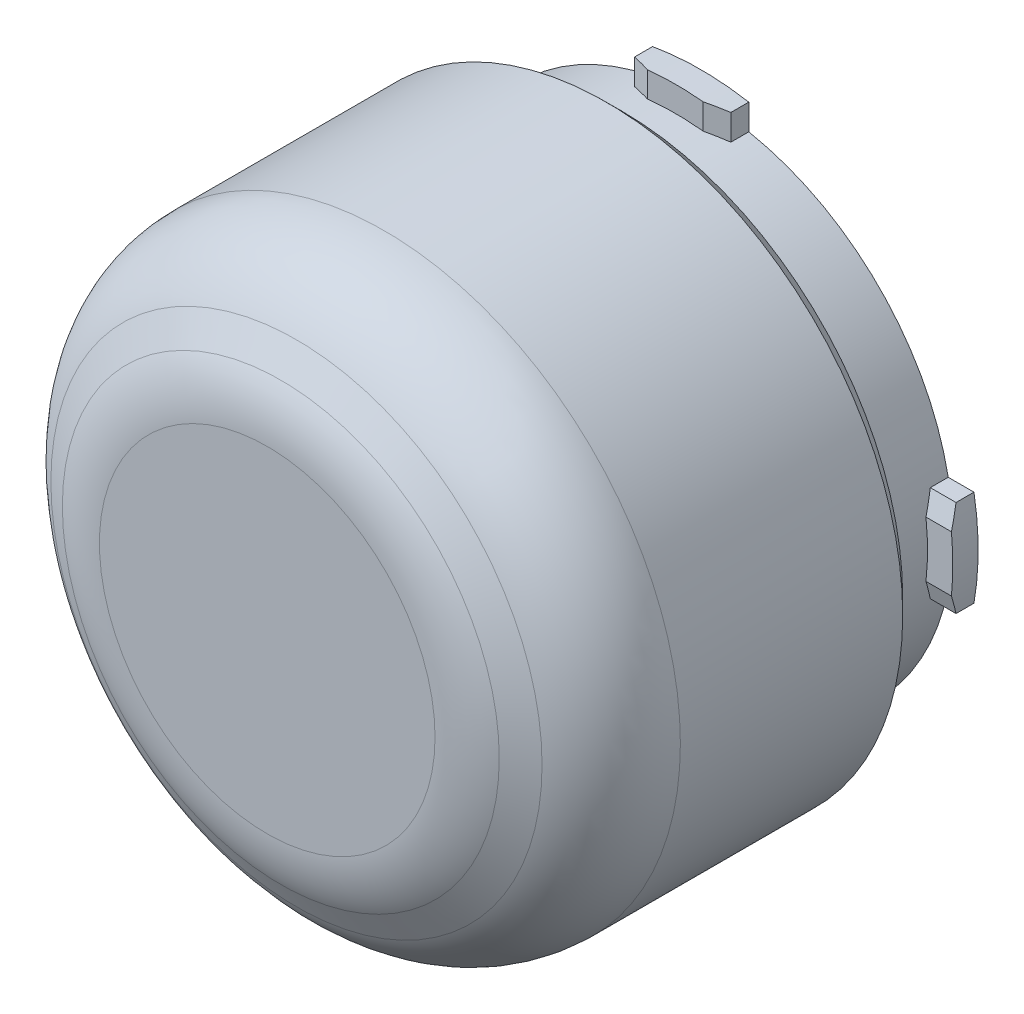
ISO-10303-21;
HEADER;
FILE_DESCRIPTION(('STEP AP214'),'2;1');
FILE_NAME('part.step','',(''),(''),'','','');
FILE_SCHEMA(('AUTOMOTIVE_DESIGN { 1 0 10303 214 1 1 1 1 }'));
ENDSEC;
DATA;
#1=APPLICATION_CONTEXT('core data for automotive mechanical design processes');
#2=APPLICATION_PROTOCOL_DEFINITION('international standard','automotive_design',2000,#1);
#3=PRODUCT_CONTEXT('',#1,'mechanical');
#4=PRODUCT('Part','Part','',(#3));
#5=PRODUCT_RELATED_PRODUCT_CATEGORY('part','',(#4));
#6=PRODUCT_DEFINITION_FORMATION('','',#4);
#7=PRODUCT_DEFINITION_CONTEXT('part definition',#1,'design');
#8=PRODUCT_DEFINITION('design','',#6,#7);
#9=PRODUCT_DEFINITION_SHAPE('','',#8);
#10=(LENGTH_UNIT() NAMED_UNIT(*) SI_UNIT(.MILLI.,.METRE.));
#11=(NAMED_UNIT(*) PLANE_ANGLE_UNIT() SI_UNIT($,.RADIAN.));
#12=(NAMED_UNIT(*) SI_UNIT($,.STERADIAN.) SOLID_ANGLE_UNIT());
#13=UNCERTAINTY_MEASURE_WITH_UNIT(LENGTH_MEASURE(1.E-05),#10,'distance_accuracy_value','');
#14=(GEOMETRIC_REPRESENTATION_CONTEXT(3) GLOBAL_UNCERTAINTY_ASSIGNED_CONTEXT((#13)) GLOBAL_UNIT_ASSIGNED_CONTEXT((#10,
#11,#12)) REPRESENTATION_CONTEXT('',''));
#15=CARTESIAN_POINT('',(0.,0.,0.));
#16=DIRECTION('',(0.,0.,1.));
#17=DIRECTION('',(1.,0.,0.));
#18=AXIS2_PLACEMENT_3D('',#15,#16,#17);
#19=CARTESIAN_POINT('',(0.,0.,35.));
#20=DIRECTION('',(0.,0.,-1.));
#21=DIRECTION('',(-1.,0.,0.));
#22=AXIS2_PLACEMENT_3D('',#19,#20,#21);
#23=CYLINDRICAL_SURFACE('',#22,29.25);
#24=CARTESIAN_POINT('',(0.,0.,23.4529946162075));
#25=DIRECTION('',(0.,0.,1.));
#26=DIRECTION('',(1.,0.,0.));
#27=AXIS2_PLACEMENT_3D('',#24,#25,#26);
#28=CIRCLE('',#27,29.25);
#29=CARTESIAN_POINT('',(29.25,0.,23.4529946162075));
#30=VERTEX_POINT('',#29);
#31=EDGE_CURVE('E11',#30,#30,#28,.F.);
#32=ORIENTED_EDGE('',*,*,#31,.T.);
#33=EDGE_LOOP('',(#32));
#34=FACE_BOUND('',#33,.T.);
#35=CARTESIAN_POINT('',(0.,0.,1.5));
#36=DIRECTION('',(0.,0.,1.));
#37=DIRECTION('',(1.,0.,0.));
#38=AXIS2_PLACEMENT_3D('',#35,#36,#37);
#39=CIRCLE('',#38,29.25);
#40=CARTESIAN_POINT('',(29.25,0.,1.5));
#41=VERTEX_POINT('',#40);
#42=EDGE_CURVE('E334',#41,#41,#39,.T.);
#43=ORIENTED_EDGE('',*,*,#42,.T.);
#44=EDGE_LOOP('',(#43));
#45=FACE_BOUND('',#44,.T.);
#46=ADVANCED_FACE('F33',(#34,#45),#23,.T.);
#47=CARTESIAN_POINT('',(0.,0.,35.));
#48=DIRECTION('',(0.,0.,1.));
#49=DIRECTION('',(1.,0.,0.));
#50=AXIS2_PLACEMENT_3D('',#47,#48,#49);
#51=PLANE('',#50);
#52=CARTESIAN_POINT('',(0.,0.,35.));
#53=DIRECTION('',(0.,0.,1.));
#54=DIRECTION('',(1.,0.,0.));
#55=AXIS2_PLACEMENT_3D('',#52,#53,#54);
#56=CIRCLE('',#55,16.5705080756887);
#57=CARTESIAN_POINT('',(16.5705080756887,0.,35.));
#58=VERTEX_POINT('',#57);
#59=EDGE_CURVE('E340',#58,#58,#56,.T.);
#60=ORIENTED_EDGE('',*,*,#59,.T.);
#61=EDGE_LOOP('',(#60));
#62=FACE_BOUND('',#61,.T.);
#63=ADVANCED_FACE('F357',(#62),#51,.T.);
#64=CARTESIAN_POINT('',(0.,0.,0.));
#65=DIRECTION('',(0.,0.,1.));
#66=DIRECTION('',(1.,0.,0.));
#67=AXIS2_PLACEMENT_3D('',#64,#65,#66);
#68=PLANE('',#67);
#69=CARTESIAN_POINT('',(0.,0.,0.));
#70=DIRECTION('',(0.,0.,1.));
#71=DIRECTION('',(1.,0.,0.));
#72=AXIS2_PLACEMENT_3D('',#69,#70,#71);
#73=CIRCLE('',#72,27.75);
#74=CARTESIAN_POINT('',(27.75,0.,0.));
#75=VERTEX_POINT('',#74);
#76=EDGE_CURVE('E337',#75,#75,#73,.F.);
#77=ORIENTED_EDGE('',*,*,#76,.T.);
#78=EDGE_LOOP('',(#77));
#79=FACE_BOUND('',#78,.T.);
#80=CARTESIAN_POINT('',(0.,0.,0.));
#81=DIRECTION('',(0.,0.,-1.));
#82=DIRECTION('',(-1.,0.,0.));
#83=AXIS2_PLACEMENT_3D('',#80,#81,#82);
#84=CIRCLE('',#83,24.9);
#85=CARTESIAN_POINT('',(-24.9,0.,0.));
#86=VERTEX_POINT('',#85);
#87=EDGE_CURVE('E221',#86,#86,#84,.T.);
#88=ORIENTED_EDGE('',*,*,#87,.F.);
#89=EDGE_LOOP('',(#88));
#90=FACE_BOUND('',#89,.T.);
#91=ADVANCED_FACE('F359',(#79,#90),#68,.F.);
#92=CARTESIAN_POINT('',(0.,0.,35.));
#93=DIRECTION('',(0.,0.,-1.));
#94=DIRECTION('',(-1.,0.,0.));
#95=AXIS2_PLACEMENT_3D('',#92,#93,#94);
#96=CONICAL_SURFACE('',#95,19.2499999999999,1.0471975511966);
#97=CARTESIAN_POINT('',(0.,0.,33.6602540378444));
#98=DIRECTION('',(0.,0.,1.));
#99=DIRECTION('',(1.,0.,0.));
#100=AXIS2_PLACEMENT_3D('',#97,#98,#99);
#101=CIRCLE('',#100,21.5705080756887);
#102=CARTESIAN_POINT('',(21.5705080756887,0.,33.6602540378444));
#103=VERTEX_POINT('',#102);
#104=EDGE_CURVE('E41',#103,#103,#101,.F.);
#105=ORIENTED_EDGE('',*,*,#104,.T.);
#106=EDGE_LOOP('',(#105));
#107=FACE_BOUND('',#106,.T.);
#108=CARTESIAN_POINT('',(0.,0.,32.1132486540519));
#109=DIRECTION('',(0.,0.,-1.));
#110=DIRECTION('',(-1.,0.,0.));
#111=AXIS2_PLACEMENT_3D('',#108,#109,#110);
#112=CIRCLE('',#111,24.25);
#113=CARTESIAN_POINT('',(-24.25,0.,32.1132486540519));
#114=VERTEX_POINT('',#113);
#115=EDGE_CURVE('E343',#114,#114,#112,.F.);
#116=ORIENTED_EDGE('',*,*,#115,.T.);
#117=EDGE_LOOP('',(#116));
#118=FACE_BOUND('',#117,.T.);
#119=ADVANCED_FACE('F348',(#107,#118),#96,.T.);
#120=CARTESIAN_POINT('',(0.,0.,72.9278354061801));
#121=DIRECTION('',(0.,0.,-1.));
#122=DIRECTION('',(-1.,0.,0.));
#123=AXIS2_PLACEMENT_3D('',#120,#121,#122);
#124=CYLINDRICAL_SURFACE('',#123,24.9);
#125=DIRECTION('',(0.,0.,-1.));
#126=VECTOR('',#125,1.);
#127=CARTESIAN_POINT('',(24.4427392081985,-4.74999999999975,-5.3));
#128=LINE('',#127,#126);
#129=CARTESIAN_POINT('',(24.4427392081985,-4.74999999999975,-6.0279404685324));
#130=VERTEX_POINT('',#129);
#131=CARTESIAN_POINT('',(24.4427392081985,-4.74999999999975,-7.8));
#132=VERTEX_POINT('',#131);
#133=EDGE_CURVE('E301',#130,#132,#128,.T.);
#134=ORIENTED_EDGE('',*,*,#133,.F.);
#135=CARTESIAN_POINT('',(0.,0.,-4.29908185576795));
#136=DIRECTION('',(0.,0.342020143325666,-0.939692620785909));
#137=DIRECTION('',(0.,-0.939692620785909,-0.342020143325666));
#138=AXIS2_PLACEMENT_3D('',#135,#136,#137);
#139=ELLIPSE('',#138,26.4980265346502,24.9);
#140=CARTESIAN_POINT('',(24.747676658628,-2.74999999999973,-5.3));
#141=VERTEX_POINT('',#140);
#142=EDGE_CURVE('E318',#130,#141,#139,.F.);
#143=ORIENTED_EDGE('',*,*,#142,.T.);
#144=CARTESIAN_POINT('',(0.,0.,-5.3));
#145=DIRECTION('',(0.,0.,1.));
#146=DIRECTION('',(0.,-1.,0.));
#147=AXIS2_PLACEMENT_3D('',#144,#145,#146);
#148=CIRCLE('',#147,24.9);
#149=CARTESIAN_POINT('',(24.7476766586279,2.75000000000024,-5.3));
#150=VERTEX_POINT('',#149);
#151=EDGE_CURVE('E313',#141,#150,#148,.T.);
#152=ORIENTED_EDGE('',*,*,#151,.T.);
#153=CARTESIAN_POINT('',(0.,0.,-4.29908185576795));
#154=DIRECTION('',(0.,-0.342020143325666,-0.939692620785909));
#155=DIRECTION('',(0.,0.939692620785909,-0.342020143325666));
#156=AXIS2_PLACEMENT_3D('',#153,#154,#155);
#157=ELLIPSE('',#156,26.4980265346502,24.9);
#158=CARTESIAN_POINT('',(24.4427392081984,4.75000000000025,-6.0279404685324));
#159=VERTEX_POINT('',#158);
#160=EDGE_CURVE('E48',#150,#159,#157,.F.);
#161=ORIENTED_EDGE('',*,*,#160,.T.);
#162=DIRECTION('',(0.,0.,-1.));
#163=VECTOR('',#162,1.);
#164=CARTESIAN_POINT('',(24.4427392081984,4.75000000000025,-5.3));
#165=LINE('',#164,#163);
#166=CARTESIAN_POINT('',(24.4427392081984,4.75000000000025,-7.8));
#167=VERTEX_POINT('',#166);
#168=EDGE_CURVE('E194',#159,#167,#165,.T.);
#169=ORIENTED_EDGE('',*,*,#168,.T.);
#170=CARTESIAN_POINT('',(0.,0.,-7.8));
#171=DIRECTION('',(0.,0.,-1.));
#172=DIRECTION('',(-1.,0.,0.));
#173=AXIS2_PLACEMENT_3D('',#170,#171,#172);
#174=CIRCLE('',#173,24.9);
#175=CARTESIAN_POINT('',(4.75,24.4427392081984,-7.8));
#176=VERTEX_POINT('',#175);
#177=EDGE_CURVE('E201',#176,#167,#174,.T.);
#178=ORIENTED_EDGE('',*,*,#177,.F.);
#179=DIRECTION('',(0.,0.,-1.));
#180=VECTOR('',#179,1.);
#181=CARTESIAN_POINT('',(4.75,24.4427392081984,-5.3));
#182=LINE('',#181,#180);
#183=CARTESIAN_POINT('',(4.75,24.4427392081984,-6.0279404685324));
#184=VERTEX_POINT('',#183);
#185=EDGE_CURVE('E238',#184,#176,#182,.T.);
#186=ORIENTED_EDGE('',*,*,#185,.F.);
#187=CARTESIAN_POINT('',(0.,0.,-4.29908185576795));
#188=DIRECTION('',(-0.342020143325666,0.,-0.939692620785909));
#189=DIRECTION('',(0.939692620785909,0.,-0.342020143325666));
#190=AXIS2_PLACEMENT_3D('',#187,#188,#189);
#191=ELLIPSE('',#190,26.4980265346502,24.9);
#192=CARTESIAN_POINT('',(2.74999999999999,24.747676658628,-5.3));
#193=VERTEX_POINT('',#192);
#194=EDGE_CURVE('E467',#184,#193,#191,.F.);
#195=ORIENTED_EDGE('',*,*,#194,.T.);
#196=CARTESIAN_POINT('',(0.,0.,-5.3));
#197=DIRECTION('',(0.,0.,1.));
#198=DIRECTION('',(1.,0.,0.));
#199=AXIS2_PLACEMENT_3D('',#196,#197,#198);
#200=CIRCLE('',#199,24.9);
#201=CARTESIAN_POINT('',(-2.74999999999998,24.747676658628,-5.3));
#202=VERTEX_POINT('',#201);
#203=EDGE_CURVE('E251',#193,#202,#200,.T.);
#204=ORIENTED_EDGE('',*,*,#203,.T.);
#205=CARTESIAN_POINT('',(0.,0.,-4.29908185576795));
#206=DIRECTION('',(0.342020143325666,0.,-0.939692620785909));
#207=DIRECTION('',(-0.939692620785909,0.,-0.342020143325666));
#208=AXIS2_PLACEMENT_3D('',#205,#206,#207);
#209=ELLIPSE('',#208,26.4980265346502,24.9);
#210=CARTESIAN_POINT('',(-4.75,24.4427392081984,-6.0279404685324));
#211=VERTEX_POINT('',#210);
#212=EDGE_CURVE('E469',#202,#211,#209,.F.);
#213=ORIENTED_EDGE('',*,*,#212,.T.);
#214=DIRECTION('',(0.,0.,-1.));
#215=VECTOR('',#214,1.);
#216=CARTESIAN_POINT('',(-4.75,24.4427392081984,-5.3));
#217=LINE('',#216,#215);
#218=CARTESIAN_POINT('',(-4.75,24.4427392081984,-7.8));
#219=VERTEX_POINT('',#218);
#220=EDGE_CURVE('E244',#211,#219,#217,.T.);
#221=ORIENTED_EDGE('',*,*,#220,.T.);
#222=CARTESIAN_POINT('',(-24.4427392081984,4.74999999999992,-7.8));
#223=VERTEX_POINT('',#222);
#224=EDGE_CURVE('E224',#223,#219,#174,.T.);
#225=ORIENTED_EDGE('',*,*,#224,.F.);
#226=DIRECTION('',(0.,0.,-1.));
#227=VECTOR('',#226,1.);
#228=CARTESIAN_POINT('',(-24.4427392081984,4.74999999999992,-5.3));
#229=LINE('',#228,#227);
#230=CARTESIAN_POINT('',(-24.4427392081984,4.74999999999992,-6.0279404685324));
#231=VERTEX_POINT('',#230);
#232=EDGE_CURVE('E256',#231,#223,#229,.T.);
#233=ORIENTED_EDGE('',*,*,#232,.F.);
#234=CARTESIAN_POINT('',(0.,0.,-4.29908185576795));
#235=DIRECTION('',(0.,-0.342020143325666,-0.939692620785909));
#236=DIRECTION('',(0.,0.939692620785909,-0.342020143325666));
#237=AXIS2_PLACEMENT_3D('',#234,#235,#236);
#238=ELLIPSE('',#237,26.4980265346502,24.9);
#239=CARTESIAN_POINT('',(-24.747676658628,2.7499999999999,-5.3));
#240=VERTEX_POINT('',#239);
#241=EDGE_CURVE('E485',#231,#240,#238,.F.);
#242=ORIENTED_EDGE('',*,*,#241,.T.);
#243=CARTESIAN_POINT('',(0.,0.,-5.3));
#244=DIRECTION('',(0.,0.,1.));
#245=DIRECTION('',(0.,1.,0.));
#246=AXIS2_PLACEMENT_3D('',#243,#244,#245);
#247=CIRCLE('',#246,24.9);
#248=CARTESIAN_POINT('',(-24.747676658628,-2.75000000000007,-5.3));
#249=VERTEX_POINT('',#248);
#250=EDGE_CURVE('E271',#240,#249,#247,.T.);
#251=ORIENTED_EDGE('',*,*,#250,.T.);
#252=CARTESIAN_POINT('',(0.,0.,-4.29908185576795));
#253=DIRECTION('',(0.,0.342020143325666,-0.939692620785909));
#254=DIRECTION('',(0.,-0.939692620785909,-0.342020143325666));
#255=AXIS2_PLACEMENT_3D('',#252,#253,#254);
#256=ELLIPSE('',#255,26.4980265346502,24.9);
#257=CARTESIAN_POINT('',(-24.4427392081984,-4.75000000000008,-6.0279404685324));
#258=VERTEX_POINT('',#257);
#259=EDGE_CURVE('E487',#249,#258,#256,.F.);
#260=ORIENTED_EDGE('',*,*,#259,.T.);
#261=DIRECTION('',(0.,0.,-1.));
#262=VECTOR('',#261,1.);
#263=CARTESIAN_POINT('',(-24.4427392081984,-4.75000000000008,-5.3));
#264=LINE('',#263,#262);
#265=CARTESIAN_POINT('',(-24.4427392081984,-4.75000000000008,-7.8));
#266=VERTEX_POINT('',#265);
#267=EDGE_CURVE('E261',#258,#266,#264,.T.);
#268=ORIENTED_EDGE('',*,*,#267,.T.);
#269=CARTESIAN_POINT('',(-4.75,-24.4427392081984,-7.8));
#270=VERTEX_POINT('',#269);
#271=EDGE_CURVE('E229',#270,#266,#174,.T.);
#272=ORIENTED_EDGE('',*,*,#271,.F.);
#273=DIRECTION('',(0.,0.,-1.));
#274=VECTOR('',#273,1.);
#275=CARTESIAN_POINT('',(-4.75,-24.4427392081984,-5.3));
#276=LINE('',#275,#274);
#277=CARTESIAN_POINT('',(-4.75,-24.4427392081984,-6.0279404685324));
#278=VERTEX_POINT('',#277);
#279=EDGE_CURVE('E278',#278,#270,#276,.T.);
#280=ORIENTED_EDGE('',*,*,#279,.F.);
#281=CARTESIAN_POINT('',(0.,0.,-4.29908185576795));
#282=DIRECTION('',(0.342020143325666,0.,-0.939692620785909));
#283=DIRECTION('',(-0.939692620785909,0.,-0.342020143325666));
#284=AXIS2_PLACEMENT_3D('',#281,#282,#283);
#285=ELLIPSE('',#284,26.4980265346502,24.9);
#286=CARTESIAN_POINT('',(-2.74999999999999,-24.747676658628,-5.3));
#287=VERTEX_POINT('',#286);
#288=EDGE_CURVE('E503',#278,#287,#285,.F.);
#289=ORIENTED_EDGE('',*,*,#288,.T.);
#290=CARTESIAN_POINT('',(0.,0.,-5.3));
#291=DIRECTION('',(0.,0.,1.));
#292=DIRECTION('',(-1.,0.,0.));
#293=AXIS2_PLACEMENT_3D('',#290,#291,#292);
#294=CIRCLE('',#293,24.9);
#295=CARTESIAN_POINT('',(2.74999999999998,-24.747676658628,-5.3));
#296=VERTEX_POINT('',#295);
#297=EDGE_CURVE('E294',#287,#296,#294,.T.);
#298=ORIENTED_EDGE('',*,*,#297,.T.);
#299=CARTESIAN_POINT('',(0.,0.,-4.29908185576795));
#300=DIRECTION('',(-0.342020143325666,0.,-0.939692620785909));
#301=DIRECTION('',(0.939692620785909,0.,-0.342020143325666));
#302=AXIS2_PLACEMENT_3D('',#299,#300,#301);
#303=ELLIPSE('',#302,26.4980265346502,24.9);
#304=CARTESIAN_POINT('',(4.75,-24.4427392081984,-6.0279404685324));
#305=VERTEX_POINT('',#304);
#306=EDGE_CURVE('E505',#296,#305,#303,.F.);
#307=ORIENTED_EDGE('',*,*,#306,.T.);
#308=DIRECTION('',(0.,0.,-1.));
#309=VECTOR('',#308,1.);
#310=CARTESIAN_POINT('',(4.75,-24.4427392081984,-5.3));
#311=LINE('',#310,#309);
#312=CARTESIAN_POINT('',(4.75,-24.4427392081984,-7.8));
#313=VERTEX_POINT('',#312);
#314=EDGE_CURVE('E283',#305,#313,#311,.T.);
#315=ORIENTED_EDGE('',*,*,#314,.T.);
#316=EDGE_CURVE('E222',#132,#313,#174,.T.);
#317=ORIENTED_EDGE('',*,*,#316,.F.);
#318=EDGE_LOOP('',(#134,#143,#152,#161,#169,#178,#186,#195,#204,#213,#221,#225,#233,#242,#251,
#260,#268,#272,#280,#289,#298,#307,#315,#317));
#319=FACE_BOUND('',#318,.T.);
#320=ORIENTED_EDGE('',*,*,#87,.T.);
#321=EDGE_LOOP('',(#320));
#322=FACE_BOUND('',#321,.T.);
#323=ADVANCED_FACE('F197',(#319,#322),#124,.T.);
#324=CARTESIAN_POINT('',(0.,0.,72.9278354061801));
#325=DIRECTION('',(0.,0.,-1.));
#326=DIRECTION('',(-1.,0.,0.));
#327=AXIS2_PLACEMENT_3D('',#324,#325,#326);
#328=CYLINDRICAL_SURFACE('',#327,22.9);
#329=CARTESIAN_POINT('',(0.,0.,3.15000000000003));
#330=DIRECTION('',(0.,0.,1.));
#331=DIRECTION('',(1.,0.,0.));
#332=AXIS2_PLACEMENT_3D('',#329,#330,#331);
#333=CIRCLE('',#332,22.9);
#334=CARTESIAN_POINT('',(22.9,0.,3.15000000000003));
#335=VERTEX_POINT('',#334);
#336=EDGE_CURVE('E327',#335,#335,#333,.T.);
#337=ORIENTED_EDGE('',*,*,#336,.T.);
#338=EDGE_LOOP('',(#337));
#339=FACE_BOUND('',#338,.T.);
#340=CARTESIAN_POINT('',(0.,0.,-7.8));
#341=DIRECTION('',(0.,0.,-1.));
#342=DIRECTION('',(-1.,0.,0.));
#343=AXIS2_PLACEMENT_3D('',#340,#341,#342);
#344=CIRCLE('',#343,22.9);
#345=CARTESIAN_POINT('',(-22.9,0.,-7.8));
#346=VERTEX_POINT('',#345);
#347=EDGE_CURVE('E231',#346,#346,#344,.T.);
#348=ORIENTED_EDGE('',*,*,#347,.T.);
#349=EDGE_LOOP('',(#348));
#350=FACE_BOUND('',#349,.T.);
#351=ADVANCED_FACE('F423',(#339,#350),#328,.F.);
#352=CARTESIAN_POINT('',(0.,0.,-7.8));
#353=DIRECTION('',(0.,0.,-1.));
#354=DIRECTION('',(-1.,0.,0.));
#355=AXIS2_PLACEMENT_3D('',#352,#353,#354);
#356=PLANE('',#355);
#357=ORIENTED_EDGE('',*,*,#177,.T.);
#358=DIRECTION('',(1.,0.,0.));
#359=VECTOR('',#358,1.);
#360=CARTESIAN_POINT('',(26.9851347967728,4.75000000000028,-7.8));
#361=LINE('',#360,#359);
#362=CARTESIAN_POINT('',(26.9851347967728,4.75000000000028,-7.8));
#363=VERTEX_POINT('',#362);
#364=EDGE_CURVE('E207',#167,#363,#361,.T.);
#365=ORIENTED_EDGE('',*,*,#364,.T.);
#366=CARTESIAN_POINT('',(-2.31065167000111E-12,0.,-7.8));
#367=DIRECTION('',(0.,0.,-1.));
#368=DIRECTION('',(0.,-1.,0.));
#369=AXIS2_PLACEMENT_3D('',#366,#367,#368);
#370=CIRCLE('',#369,27.4000000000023);
#371=CARTESIAN_POINT('',(26.9851347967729,-4.74999999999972,-7.8));
#372=VERTEX_POINT('',#371);
#373=EDGE_CURVE('E213',#363,#372,#370,.T.);
#374=ORIENTED_EDGE('',*,*,#373,.T.);
#375=DIRECTION('',(-1.,0.,0.));
#376=VECTOR('',#375,1.);
#377=CARTESIAN_POINT('',(26.9851347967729,-4.74999999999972,-7.8));
#378=LINE('',#377,#376);
#379=EDGE_CURVE('E310',#372,#132,#378,.T.);
#380=ORIENTED_EDGE('',*,*,#379,.T.);
#381=ORIENTED_EDGE('',*,*,#316,.T.);
#382=DIRECTION('',(0.,-1.,0.));
#383=VECTOR('',#382,1.);
#384=CARTESIAN_POINT('',(4.75,-26.9851347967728,-7.8));
#385=LINE('',#384,#383);
#386=CARTESIAN_POINT('',(4.75,-26.9851347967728,-7.8));
#387=VERTEX_POINT('',#386);
#388=EDGE_CURVE('E298',#313,#387,#385,.T.);
#389=ORIENTED_EDGE('',*,*,#388,.T.);
#390=CARTESIAN_POINT('',(0.,2.31065167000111E-12,-7.8));
#391=DIRECTION('',(0.,0.,-1.));
#392=DIRECTION('',(-1.,0.,0.));
#393=AXIS2_PLACEMENT_3D('',#390,#391,#392);
#394=CIRCLE('',#393,27.4000000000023);
#395=CARTESIAN_POINT('',(-4.75,-26.9851347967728,-7.8));
#396=VERTEX_POINT('',#395);
#397=EDGE_CURVE('E295',#387,#396,#394,.T.);
#398=ORIENTED_EDGE('',*,*,#397,.T.);
#399=DIRECTION('',(0.,1.,0.));
#400=VECTOR('',#399,1.);
#401=CARTESIAN_POINT('',(-4.75,-26.9851347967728,-7.8));
#402=LINE('',#401,#400);
#403=EDGE_CURVE('E291',#396,#270,#402,.T.);
#404=ORIENTED_EDGE('',*,*,#403,.T.);
#405=ORIENTED_EDGE('',*,*,#271,.T.);
#406=DIRECTION('',(-1.,0.,0.));
#407=VECTOR('',#406,1.);
#408=CARTESIAN_POINT('',(-26.9851347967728,-4.75000000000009,-7.8));
#409=LINE('',#408,#407);
#410=CARTESIAN_POINT('',(-26.9851347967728,-4.7500000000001,-7.8));
#411=VERTEX_POINT('',#410);
#412=EDGE_CURVE('E275',#266,#411,#409,.T.);
#413=ORIENTED_EDGE('',*,*,#412,.T.);
#414=CARTESIAN_POINT('',(2.31065167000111E-12,0.,-7.8));
#415=DIRECTION('',(0.,0.,-1.));
#416=DIRECTION('',(0.,1.,0.));
#417=AXIS2_PLACEMENT_3D('',#414,#415,#416);
#418=CIRCLE('',#417,27.4000000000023);
#419=CARTESIAN_POINT('',(-26.9851347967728,4.74999999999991,-7.8));
#420=VERTEX_POINT('',#419);
#421=EDGE_CURVE('E272',#411,#420,#418,.T.);
#422=ORIENTED_EDGE('',*,*,#421,.T.);
#423=DIRECTION('',(1.,0.,0.));
#424=VECTOR('',#423,1.);
#425=CARTESIAN_POINT('',(-26.9851347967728,4.74999999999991,-7.8));
#426=LINE('',#425,#424);
#427=EDGE_CURVE('E269',#420,#223,#426,.T.);
#428=ORIENTED_EDGE('',*,*,#427,.T.);
#429=ORIENTED_EDGE('',*,*,#224,.T.);
#430=DIRECTION('',(0.,1.,0.));
#431=VECTOR('',#430,1.);
#432=CARTESIAN_POINT('',(-4.75,26.9851347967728,-7.8));
#433=LINE('',#432,#431);
#434=CARTESIAN_POINT('',(-4.75,26.9851347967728,-7.8));
#435=VERTEX_POINT('',#434);
#436=EDGE_CURVE('E254',#219,#435,#433,.T.);
#437=ORIENTED_EDGE('',*,*,#436,.T.);
#438=CARTESIAN_POINT('',(0.,-2.31065167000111E-12,-7.8));
#439=DIRECTION('',(0.,0.,-1.));
#440=DIRECTION('',(1.,0.,0.));
#441=AXIS2_PLACEMENT_3D('',#438,#439,#440);
#442=CIRCLE('',#441,27.4000000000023);
#443=CARTESIAN_POINT('',(4.75,26.9851347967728,-7.8));
#444=VERTEX_POINT('',#443);
#445=EDGE_CURVE('E252',#435,#444,#442,.T.);
#446=ORIENTED_EDGE('',*,*,#445,.T.);
#447=DIRECTION('',(0.,-1.,0.));
#448=VECTOR('',#447,1.);
#449=CARTESIAN_POINT('',(4.75,26.9851347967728,-7.8));
#450=LINE('',#449,#448);
#451=EDGE_CURVE('E220',#444,#176,#450,.T.);
#452=ORIENTED_EDGE('',*,*,#451,.T.);
#453=EDGE_LOOP('',(#357,#365,#374,#380,#381,#389,#398,#404,#405,#413,#422,#428,#429,#437,#446,#452));
#454=FACE_BOUND('',#453,.T.);
#455=ORIENTED_EDGE('',*,*,#347,.F.);
#456=EDGE_LOOP('',(#455));
#457=FACE_BOUND('',#456,.T.);
#458=ADVANCED_FACE('F216',(#454,#457),#356,.T.);
#459=CARTESIAN_POINT('',(0.,0.,32.5));
#460=DIRECTION('',(0.,0.,1.));
#461=DIRECTION('',(1.,0.,0.));
#462=AXIS2_PLACEMENT_3D('',#459,#460,#461);
#463=PLANE('',#462);
#464=CARTESIAN_POINT('',(0.,0.,32.5));
#465=DIRECTION('',(0.,0.,1.));
#466=DIRECTION('',(1.,0.,0.));
#467=AXIS2_PLACEMENT_3D('',#464,#465,#466);
#468=CIRCLE('',#467,18.5801270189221);
#469=CARTESIAN_POINT('',(18.5801270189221,0.,32.5));
#470=VERTEX_POINT('',#469);
#471=EDGE_CURVE('E226',#470,#470,#468,.T.);
#472=ORIENTED_EDGE('',*,*,#471,.F.);
#473=EDGE_LOOP('',(#472));
#474=FACE_BOUND('',#473,.T.);
#475=ADVANCED_FACE('F437',(#474),#463,.F.);
#476=CARTESIAN_POINT('',(0.,0.,32.8349364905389));
#477=DIRECTION('',(0.,0.,-1.));
#478=DIRECTION('',(-1.,0.,0.));
#479=AXIS2_PLACEMENT_3D('',#476,#477,#478);
#480=CONICAL_SURFACE('',#479,17.9999999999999,1.0471975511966);
#481=CARTESIAN_POINT('',(0.,0.,27.7831216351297));
#482=DIRECTION('',(0.,0.,-1.));
#483=DIRECTION('',(-1.,0.,0.));
#484=AXIS2_PLACEMENT_3D('',#481,#482,#483);
#485=CIRCLE('',#484,26.75);
#486=CARTESIAN_POINT('',(-26.75,0.,27.7831216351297));
#487=VERTEX_POINT('',#486);
#488=EDGE_CURVE('E448',#487,#487,#485,.T.);
#489=ORIENTED_EDGE('',*,*,#488,.T.);
#490=EDGE_LOOP('',(#489));
#491=FACE_BOUND('',#490,.T.);
#492=ORIENTED_EDGE('',*,*,#471,.T.);
#493=EDGE_LOOP('',(#492));
#494=FACE_BOUND('',#493,.T.);
#495=ADVANCED_FACE('F371',(#491,#494),#480,.F.);
#496=CARTESIAN_POINT('',(0.,0.,35.));
#497=DIRECTION('',(0.,0.,-1.));
#498=DIRECTION('',(-1.,0.,0.));
#499=AXIS2_PLACEMENT_3D('',#496,#497,#498);
#500=CYLINDRICAL_SURFACE('',#499,26.75);
#501=CARTESIAN_POINT('',(0.,0.,7.00000000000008));
#502=DIRECTION('',(0.,0.,-1.));
#503=DIRECTION('',(-1.,0.,0.));
#504=AXIS2_PLACEMENT_3D('',#501,#502,#503);
#505=CIRCLE('',#504,26.75);
#506=CARTESIAN_POINT('',(-26.75,0.,7.00000000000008));
#507=VERTEX_POINT('',#506);
#508=EDGE_CURVE('E324',#507,#507,#505,.T.);
#509=ORIENTED_EDGE('',*,*,#508,.T.);
#510=EDGE_LOOP('',(#509));
#511=FACE_BOUND('',#510,.T.);
#512=ORIENTED_EDGE('',*,*,#488,.F.);
#513=EDGE_LOOP('',(#512));
#514=FACE_BOUND('',#513,.T.);
#515=ADVANCED_FACE('F433',(#511,#514),#500,.F.);
#516=CARTESIAN_POINT('',(4.75,26.9851347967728,-5.3));
#517=DIRECTION('',(1.,0.,0.));
#518=DIRECTION('',(0.,0.,-1.));
#519=AXIS2_PLACEMENT_3D('',#516,#517,#518);
#520=PLANE('',#519);
#521=DIRECTION('',(0.,0.,-1.));
#522=VECTOR('',#521,1.);
#523=CARTESIAN_POINT('',(4.75,26.9851347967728,-5.3));
#524=LINE('',#523,#522);
#525=CARTESIAN_POINT('',(4.75,26.9851347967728,-6.0279404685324));
#526=VERTEX_POINT('',#525);
#527=EDGE_CURVE('E241',#526,#444,#524,.T.);
#528=ORIENTED_EDGE('',*,*,#527,.F.);
#529=DIRECTION('',(0.,-1.,0.));
#530=VECTOR('',#529,1.);
#531=CARTESIAN_POINT('',(4.75,26.9851347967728,-6.0279404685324));
#532=LINE('',#531,#530);
#533=EDGE_CURVE('E451',#526,#184,#532,.T.);
#534=ORIENTED_EDGE('',*,*,#533,.T.);
#535=ORIENTED_EDGE('',*,*,#185,.T.);
#536=ORIENTED_EDGE('',*,*,#451,.F.);
#537=EDGE_LOOP('',(#528,#534,#535,#536));
#538=FACE_BOUND('',#537,.T.);
#539=ADVANCED_FACE('F435',(#538),#520,.T.);
#540=CARTESIAN_POINT('',(0.,-2.31065167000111E-12,-5.3));
#541=DIRECTION('',(0.,0.,-1.));
#542=DIRECTION('',(-1.,0.,0.));
#543=AXIS2_PLACEMENT_3D('',#540,#541,#542);
#544=CYLINDRICAL_SURFACE('',#543,27.4000000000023);
#545=CARTESIAN_POINT('',(0.,-2.31065167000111E-12,-5.3));
#546=DIRECTION('',(0.,0.,-1.));
#547=DIRECTION('',(1.,0.,0.));
#548=AXIS2_PLACEMENT_3D('',#545,#546,#547);
#549=CIRCLE('',#548,27.4000000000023);
#550=CARTESIAN_POINT('',(-2.74999999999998,27.2616488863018,-5.3));
#551=VERTEX_POINT('',#550);
#552=CARTESIAN_POINT('',(2.74999999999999,27.2616488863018,-5.3));
#553=VERTEX_POINT('',#552);
#554=EDGE_CURVE('E247',#551,#553,#549,.T.);
#555=ORIENTED_EDGE('',*,*,#554,.T.);
#556=CARTESIAN_POINT('',(0.,-2.31065167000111E-12,-4.29908185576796));
#557=DIRECTION('',(-0.342020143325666,0.,-0.939692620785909));
#558=DIRECTION('',(0.939692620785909,0.,-0.342020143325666));
#559=AXIS2_PLACEMENT_3D('',#556,#557,#558);
#560=ELLIPSE('',#559,29.1584709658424,27.4000000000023);
#561=EDGE_CURVE('E462',#553,#526,#560,.T.);
#562=ORIENTED_EDGE('',*,*,#561,.T.);
#563=ORIENTED_EDGE('',*,*,#527,.T.);
#564=ORIENTED_EDGE('',*,*,#445,.F.);
#565=DIRECTION('',(0.,0.,-1.));
#566=VECTOR('',#565,1.);
#567=CARTESIAN_POINT('',(-4.75,26.9851347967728,-5.3));
#568=LINE('',#567,#566);
#569=CARTESIAN_POINT('',(-4.75,26.9851347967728,-6.0279404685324));
#570=VERTEX_POINT('',#569);
#571=EDGE_CURVE('E246',#570,#435,#568,.T.);
#572=ORIENTED_EDGE('',*,*,#571,.F.);
#573=CARTESIAN_POINT('',(0.,-2.31065167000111E-12,-4.29908185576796));
#574=DIRECTION('',(0.342020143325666,0.,-0.939692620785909));
#575=DIRECTION('',(-0.939692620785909,0.,-0.342020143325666));
#576=AXIS2_PLACEMENT_3D('',#573,#574,#575);
#577=ELLIPSE('',#576,29.1584709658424,27.4000000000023);
#578=EDGE_CURVE('E460',#570,#551,#577,.T.);
#579=ORIENTED_EDGE('',*,*,#578,.T.);
#580=EDGE_LOOP('',(#555,#562,#563,#564,#572,#579));
#581=FACE_BOUND('',#580,.T.);
#582=ADVANCED_FACE('F574',(#581),#544,.T.);
#583=CARTESIAN_POINT('',(-4.75,26.9851347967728,-5.3));
#584=DIRECTION('',(-1.,0.,0.));
#585=DIRECTION('',(0.,0.,1.));
#586=AXIS2_PLACEMENT_3D('',#583,#584,#585);
#587=PLANE('',#586);
#588=ORIENTED_EDGE('',*,*,#220,.F.);
#589=DIRECTION('',(0.,1.,0.));
#590=VECTOR('',#589,1.);
#591=CARTESIAN_POINT('',(-4.75,26.9851347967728,-6.0279404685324));
#592=LINE('',#591,#590);
#593=EDGE_CURVE('E464',#211,#570,#592,.T.);
#594=ORIENTED_EDGE('',*,*,#593,.T.);
#595=ORIENTED_EDGE('',*,*,#571,.T.);
#596=ORIENTED_EDGE('',*,*,#436,.F.);
#597=EDGE_LOOP('',(#588,#594,#595,#596));
#598=FACE_BOUND('',#597,.T.);
#599=ADVANCED_FACE('F561',(#598),#587,.T.);
#600=CARTESIAN_POINT('',(0.,0.,-5.3));
#601=DIRECTION('',(0.,0.,1.));
#602=DIRECTION('',(1.,0.,0.));
#603=AXIS2_PLACEMENT_3D('',#600,#601,#602);
#604=PLANE('',#603);
#605=ORIENTED_EDGE('',*,*,#203,.F.);
#606=DIRECTION('',(0.,1.,0.));
#607=VECTOR('',#606,1.);
#608=CARTESIAN_POINT('',(2.74999999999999,0.,-5.3));
#609=LINE('',#608,#607);
#610=EDGE_CURVE('E458',#193,#553,#609,.T.);
#611=ORIENTED_EDGE('',*,*,#610,.T.);
#612=ORIENTED_EDGE('',*,*,#554,.F.);
#613=DIRECTION('',(0.,-1.,0.));
#614=VECTOR('',#613,1.);
#615=CARTESIAN_POINT('',(-2.74999999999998,0.,-5.3));
#616=LINE('',#615,#614);
#617=EDGE_CURVE('E456',#551,#202,#616,.T.);
#618=ORIENTED_EDGE('',*,*,#617,.T.);
#619=EDGE_LOOP('',(#605,#611,#612,#618));
#620=FACE_BOUND('',#619,.T.);
#621=ADVANCED_FACE('F379',(#620),#604,.T.);
#622=CARTESIAN_POINT('',(4.75,26.9851347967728,-6.0279404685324));
#623=DIRECTION('',(-0.342020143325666,0.,-0.939692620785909));
#624=DIRECTION('',(0.,-1.,0.));
#625=AXIS2_PLACEMENT_3D('',#622,#623,#624);
#626=PLANE('',#625);
#627=ORIENTED_EDGE('',*,*,#561,.F.);
#628=ORIENTED_EDGE('',*,*,#610,.F.);
#629=ORIENTED_EDGE('',*,*,#194,.F.);
#630=ORIENTED_EDGE('',*,*,#533,.F.);
#631=EDGE_LOOP('',(#627,#628,#629,#630));
#632=FACE_BOUND('',#631,.T.);
#633=ADVANCED_FACE('F375',(#632),#626,.F.);
#634=CARTESIAN_POINT('',(-4.75,26.9851347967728,-6.0279404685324));
#635=DIRECTION('',(0.342020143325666,0.,-0.939692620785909));
#636=DIRECTION('',(0.,1.,0.));
#637=AXIS2_PLACEMENT_3D('',#634,#635,#636);
#638=PLANE('',#637);
#639=ORIENTED_EDGE('',*,*,#212,.F.);
#640=ORIENTED_EDGE('',*,*,#617,.F.);
#641=ORIENTED_EDGE('',*,*,#578,.F.);
#642=ORIENTED_EDGE('',*,*,#593,.F.);
#643=EDGE_LOOP('',(#639,#640,#641,#642));
#644=FACE_BOUND('',#643,.T.);
#645=ADVANCED_FACE('F378',(#644),#638,.F.);
#646=CARTESIAN_POINT('',(-26.9851347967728,4.74999999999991,-5.3));
#647=DIRECTION('',(0.,1.,0.));
#648=DIRECTION('',(-1.,0.,0.));
#649=AXIS2_PLACEMENT_3D('',#646,#647,#648);
#650=PLANE('',#649);
#651=DIRECTION('',(0.,0.,-1.));
#652=VECTOR('',#651,1.);
#653=CARTESIAN_POINT('',(-26.9851347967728,4.74999999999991,-5.3));
#654=LINE('',#653,#652);
#655=CARTESIAN_POINT('',(-26.9851347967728,4.74999999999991,-6.0279404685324));
#656=VERTEX_POINT('',#655);
#657=EDGE_CURVE('E266',#656,#420,#654,.T.);
#658=ORIENTED_EDGE('',*,*,#657,.F.);
#659=DIRECTION('',(1.,0.,0.));
#660=VECTOR('',#659,1.);
#661=CARTESIAN_POINT('',(-26.9851347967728,4.74999999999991,-6.0279404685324));
#662=LINE('',#661,#660);
#663=EDGE_CURVE('E471',#656,#231,#662,.T.);
#664=ORIENTED_EDGE('',*,*,#663,.T.);
#665=ORIENTED_EDGE('',*,*,#232,.T.);
#666=ORIENTED_EDGE('',*,*,#427,.F.);
#667=EDGE_LOOP('',(#658,#664,#665,#666));
#668=FACE_BOUND('',#667,.T.);
#669=ADVANCED_FACE('F383',(#668),#650,.T.);
#670=CARTESIAN_POINT('',(2.31065167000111E-12,0.,-5.3));
#671=DIRECTION('',(0.,0.,-1.));
#672=DIRECTION('',(-1.,0.,0.));
#673=AXIS2_PLACEMENT_3D('',#670,#671,#672);
#674=CYLINDRICAL_SURFACE('',#673,27.4000000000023);
#675=CARTESIAN_POINT('',(2.31065167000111E-12,0.,-5.3));
#676=DIRECTION('',(0.,0.,-1.));
#677=DIRECTION('',(0.,1.,0.));
#678=AXIS2_PLACEMENT_3D('',#675,#676,#677);
#679=CIRCLE('',#678,27.4000000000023);
#680=CARTESIAN_POINT('',(-27.2616488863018,-2.75000000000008,-5.3));
#681=VERTEX_POINT('',#680);
#682=CARTESIAN_POINT('',(-27.2616488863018,2.74999999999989,-5.3));
#683=VERTEX_POINT('',#682);
#684=EDGE_CURVE('E264',#681,#683,#679,.T.);
#685=ORIENTED_EDGE('',*,*,#684,.T.);
#686=CARTESIAN_POINT('',(2.31065167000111E-12,0.,-4.29908185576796));
#687=DIRECTION('',(0.,-0.342020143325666,-0.939692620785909));
#688=DIRECTION('',(0.,0.939692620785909,-0.342020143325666));
#689=AXIS2_PLACEMENT_3D('',#686,#687,#688);
#690=ELLIPSE('',#689,29.1584709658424,27.4000000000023);
#691=EDGE_CURVE('E480',#683,#656,#690,.T.);
#692=ORIENTED_EDGE('',*,*,#691,.T.);
#693=ORIENTED_EDGE('',*,*,#657,.T.);
#694=ORIENTED_EDGE('',*,*,#421,.F.);
#695=DIRECTION('',(0.,0.,-1.));
#696=VECTOR('',#695,1.);
#697=CARTESIAN_POINT('',(-26.9851347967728,-4.7500000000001,-5.3));
#698=LINE('',#697,#696);
#699=CARTESIAN_POINT('',(-26.9851347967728,-4.7500000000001,-6.0279404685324));
#700=VERTEX_POINT('',#699);
#701=EDGE_CURVE('E263',#700,#411,#698,.T.);
#702=ORIENTED_EDGE('',*,*,#701,.F.);
#703=CARTESIAN_POINT('',(2.31065167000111E-12,0.,-4.29908185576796));
#704=DIRECTION('',(0.,0.342020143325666,-0.939692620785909));
#705=DIRECTION('',(0.,-0.939692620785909,-0.342020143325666));
#706=AXIS2_PLACEMENT_3D('',#703,#704,#705);
#707=ELLIPSE('',#706,29.1584709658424,27.4000000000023);
#708=EDGE_CURVE('E478',#700,#681,#707,.T.);
#709=ORIENTED_EDGE('',*,*,#708,.T.);
#710=EDGE_LOOP('',(#685,#692,#693,#694,#702,#709));
#711=FACE_BOUND('',#710,.T.);
#712=ADVANCED_FACE('F549',(#711),#674,.T.);
#713=CARTESIAN_POINT('',(-26.9851347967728,-4.75000000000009,-5.3));
#714=DIRECTION('',(0.,-1.,0.));
#715=DIRECTION('',(1.,0.,0.));
#716=AXIS2_PLACEMENT_3D('',#713,#714,#715);
#717=PLANE('',#716);
#718=ORIENTED_EDGE('',*,*,#267,.F.);
#719=DIRECTION('',(-1.,0.,0.));
#720=VECTOR('',#719,1.);
#721=CARTESIAN_POINT('',(-26.9851347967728,-4.75000000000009,-6.0279404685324));
#722=LINE('',#721,#720);
#723=EDGE_CURVE('E482',#258,#700,#722,.T.);
#724=ORIENTED_EDGE('',*,*,#723,.T.);
#725=ORIENTED_EDGE('',*,*,#701,.T.);
#726=ORIENTED_EDGE('',*,*,#412,.F.);
#727=EDGE_LOOP('',(#718,#724,#725,#726));
#728=FACE_BOUND('',#727,.T.);
#729=ADVANCED_FACE('F544',(#728),#717,.T.);
#730=CARTESIAN_POINT('',(0.,0.,-5.3));
#731=DIRECTION('',(0.,0.,1.));
#732=DIRECTION('',(0.,1.,0.));
#733=AXIS2_PLACEMENT_3D('',#730,#731,#732);
#734=PLANE('',#733);
#735=ORIENTED_EDGE('',*,*,#250,.F.);
#736=DIRECTION('',(-1.,0.,0.));
#737=VECTOR('',#736,1.);
#738=CARTESIAN_POINT('',(0.,2.74999999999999,-5.3));
#739=LINE('',#738,#737);
#740=EDGE_CURVE('E476',#240,#683,#739,.T.);
#741=ORIENTED_EDGE('',*,*,#740,.T.);
#742=ORIENTED_EDGE('',*,*,#684,.F.);
#743=DIRECTION('',(1.,0.,0.));
#744=VECTOR('',#743,1.);
#745=CARTESIAN_POINT('',(0.,-2.74999999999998,-5.3));
#746=LINE('',#745,#744);
#747=EDGE_CURVE('E474',#681,#249,#746,.T.);
#748=ORIENTED_EDGE('',*,*,#747,.T.);
#749=EDGE_LOOP('',(#735,#741,#742,#748));
#750=FACE_BOUND('',#749,.T.);
#751=ADVANCED_FACE('F588',(#750),#734,.T.);
#752=CARTESIAN_POINT('',(-4.75,-26.9851347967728,-5.3));
#753=DIRECTION('',(-1.,0.,0.));
#754=DIRECTION('',(0.,0.,1.));
#755=AXIS2_PLACEMENT_3D('',#752,#753,#754);
#756=PLANE('',#755);
#757=DIRECTION('',(0.,0.,-1.));
#758=VECTOR('',#757,1.);
#759=CARTESIAN_POINT('',(-4.75,-26.9851347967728,-5.3));
#760=LINE('',#759,#758);
#761=CARTESIAN_POINT('',(-4.75,-26.9851347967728,-6.0279404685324));
#762=VERTEX_POINT('',#761);
#763=EDGE_CURVE('E288',#762,#396,#760,.T.);
#764=ORIENTED_EDGE('',*,*,#763,.F.);
#765=DIRECTION('',(0.,1.,0.));
#766=VECTOR('',#765,1.);
#767=CARTESIAN_POINT('',(-4.75,-26.9851347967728,-6.0279404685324));
#768=LINE('',#767,#766);
#769=EDGE_CURVE('E489',#762,#278,#768,.T.);
#770=ORIENTED_EDGE('',*,*,#769,.T.);
#771=ORIENTED_EDGE('',*,*,#279,.T.);
#772=ORIENTED_EDGE('',*,*,#403,.F.);
#773=EDGE_LOOP('',(#764,#770,#771,#772));
#774=FACE_BOUND('',#773,.T.);
#775=ADVANCED_FACE('F537',(#774),#756,.T.);
#776=CARTESIAN_POINT('',(0.,2.31065167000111E-12,-5.3));
#777=DIRECTION('',(0.,0.,-1.));
#778=DIRECTION('',(-1.,0.,0.));
#779=AXIS2_PLACEMENT_3D('',#776,#777,#778);
#780=CYLINDRICAL_SURFACE('',#779,27.4000000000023);
#781=CARTESIAN_POINT('',(0.,2.31065167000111E-12,-5.3));
#782=DIRECTION('',(0.,0.,-1.));
#783=DIRECTION('',(-1.,0.,0.));
#784=AXIS2_PLACEMENT_3D('',#781,#782,#783);
#785=CIRCLE('',#784,27.4000000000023);
#786=CARTESIAN_POINT('',(2.74999999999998,-27.2616488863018,-5.3));
#787=VERTEX_POINT('',#786);
#788=CARTESIAN_POINT('',(-2.74999999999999,-27.2616488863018,-5.3));
#789=VERTEX_POINT('',#788);
#790=EDGE_CURVE('E286',#787,#789,#785,.T.);
#791=ORIENTED_EDGE('',*,*,#790,.T.);
#792=CARTESIAN_POINT('',(0.,2.31065167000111E-12,-4.29908185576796));
#793=DIRECTION('',(0.342020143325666,0.,-0.939692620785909));
#794=DIRECTION('',(-0.939692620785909,0.,-0.342020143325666));
#795=AXIS2_PLACEMENT_3D('',#792,#793,#794);
#796=ELLIPSE('',#795,29.1584709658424,27.4000000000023);
#797=EDGE_CURVE('E498',#789,#762,#796,.T.);
#798=ORIENTED_EDGE('',*,*,#797,.T.);
#799=ORIENTED_EDGE('',*,*,#763,.T.);
#800=ORIENTED_EDGE('',*,*,#397,.F.);
#801=DIRECTION('',(0.,0.,-1.));
#802=VECTOR('',#801,1.);
#803=CARTESIAN_POINT('',(4.75,-26.9851347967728,-5.3));
#804=LINE('',#803,#802);
#805=CARTESIAN_POINT('',(4.75,-26.9851347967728,-6.0279404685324));
#806=VERTEX_POINT('',#805);
#807=EDGE_CURVE('E285',#806,#387,#804,.T.);
#808=ORIENTED_EDGE('',*,*,#807,.F.);
#809=CARTESIAN_POINT('',(0.,2.31065167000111E-12,-4.29908185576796));
#810=DIRECTION('',(-0.342020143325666,0.,-0.939692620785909));
#811=DIRECTION('',(0.939692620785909,0.,-0.342020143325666));
#812=AXIS2_PLACEMENT_3D('',#809,#810,#811);
#813=ELLIPSE('',#812,29.1584709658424,27.4000000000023);
#814=EDGE_CURVE('E496',#806,#787,#813,.T.);
#815=ORIENTED_EDGE('',*,*,#814,.T.);
#816=EDGE_LOOP('',(#791,#798,#799,#800,#808,#815));
#817=FACE_BOUND('',#816,.T.);
#818=ADVANCED_FACE('F532',(#817),#780,.T.);
#819=CARTESIAN_POINT('',(4.75,-26.9851347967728,-5.3));
#820=DIRECTION('',(1.,0.,0.));
#821=DIRECTION('',(0.,0.,-1.));
#822=AXIS2_PLACEMENT_3D('',#819,#820,#821);
#823=PLANE('',#822);
#824=ORIENTED_EDGE('',*,*,#314,.F.);
#825=DIRECTION('',(0.,-1.,0.));
#826=VECTOR('',#825,1.);
#827=CARTESIAN_POINT('',(4.75,-26.9851347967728,-6.0279404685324));
#828=LINE('',#827,#826);
#829=EDGE_CURVE('E500',#305,#806,#828,.T.);
#830=ORIENTED_EDGE('',*,*,#829,.T.);
#831=ORIENTED_EDGE('',*,*,#807,.T.);
#832=ORIENTED_EDGE('',*,*,#388,.F.);
#833=EDGE_LOOP('',(#824,#830,#831,#832));
#834=FACE_BOUND('',#833,.T.);
#835=ADVANCED_FACE('F527',(#834),#823,.T.);
#836=CARTESIAN_POINT('',(0.,0.,-5.3));
#837=DIRECTION('',(0.,0.,1.));
#838=DIRECTION('',(-1.,0.,0.));
#839=AXIS2_PLACEMENT_3D('',#836,#837,#838);
#840=PLANE('',#839);
#841=ORIENTED_EDGE('',*,*,#297,.F.);
#842=DIRECTION('',(0.,-1.,0.));
#843=VECTOR('',#842,1.);
#844=CARTESIAN_POINT('',(-2.74999999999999,0.,-5.3));
#845=LINE('',#844,#843);
#846=EDGE_CURVE('E494',#287,#789,#845,.T.);
#847=ORIENTED_EDGE('',*,*,#846,.T.);
#848=ORIENTED_EDGE('',*,*,#790,.F.);
#849=DIRECTION('',(0.,1.,0.));
#850=VECTOR('',#849,1.);
#851=CARTESIAN_POINT('',(2.74999999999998,0.,-5.3));
#852=LINE('',#851,#850);
#853=EDGE_CURVE('E492',#787,#296,#852,.T.);
#854=ORIENTED_EDGE('',*,*,#853,.T.);
#855=EDGE_LOOP('',(#841,#847,#848,#854));
#856=FACE_BOUND('',#855,.T.);
#857=ADVANCED_FACE('F598',(#856),#840,.T.);
#858=CARTESIAN_POINT('',(26.9851347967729,-4.74999999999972,-5.3));
#859=DIRECTION('',(0.,-1.,0.));
#860=DIRECTION('',(1.,0.,0.));
#861=AXIS2_PLACEMENT_3D('',#858,#859,#860);
#862=PLANE('',#861);
#863=DIRECTION('',(0.,0.,-1.));
#864=VECTOR('',#863,1.);
#865=CARTESIAN_POINT('',(26.9851347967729,-4.74999999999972,-5.3));
#866=LINE('',#865,#864);
#867=CARTESIAN_POINT('',(26.9851347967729,-4.74999999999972,-6.0279404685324));
#868=VERTEX_POINT('',#867);
#869=EDGE_CURVE('E307',#868,#372,#866,.T.);
#870=ORIENTED_EDGE('',*,*,#869,.F.);
#871=DIRECTION('',(-1.,0.,0.));
#872=VECTOR('',#871,1.);
#873=CARTESIAN_POINT('',(26.9851347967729,-4.74999999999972,-6.0279404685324));
#874=LINE('',#873,#872);
#875=EDGE_CURVE('E507',#868,#130,#874,.T.);
#876=ORIENTED_EDGE('',*,*,#875,.T.);
#877=ORIENTED_EDGE('',*,*,#133,.T.);
#878=ORIENTED_EDGE('',*,*,#379,.F.);
#879=EDGE_LOOP('',(#870,#876,#877,#878));
#880=FACE_BOUND('',#879,.T.);
#881=ADVANCED_FACE('F522',(#880),#862,.T.);
#882=CARTESIAN_POINT('',(-2.31065167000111E-12,0.,-5.3));
#883=DIRECTION('',(0.,0.,-1.));
#884=DIRECTION('',(-1.,0.,0.));
#885=AXIS2_PLACEMENT_3D('',#882,#883,#884);
#886=CYLINDRICAL_SURFACE('',#885,27.4000000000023);
#887=CARTESIAN_POINT('',(-2.31065167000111E-12,0.,-5.3));
#888=DIRECTION('',(0.,0.,-1.));
#889=DIRECTION('',(0.,-1.,0.));
#890=AXIS2_PLACEMENT_3D('',#887,#888,#889);
#891=CIRCLE('',#890,27.4000000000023);
#892=CARTESIAN_POINT('',(27.2616488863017,2.75000000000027,-5.3));
#893=VERTEX_POINT('',#892);
#894=CARTESIAN_POINT('',(27.2616488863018,-2.7499999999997,-5.3));
#895=VERTEX_POINT('',#894);
#896=EDGE_CURVE('E204',#893,#895,#891,.T.);
#897=ORIENTED_EDGE('',*,*,#896,.T.);
#898=CARTESIAN_POINT('',(-2.31065167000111E-12,0.,-4.29908185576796));
#899=DIRECTION('',(0.,0.342020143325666,-0.939692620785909));
#900=DIRECTION('',(0.,-0.939692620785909,-0.342020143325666));
#901=AXIS2_PLACEMENT_3D('',#898,#899,#900);
#902=ELLIPSE('',#901,29.1584709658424,27.4000000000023);
#903=EDGE_CURVE('E514',#895,#868,#902,.T.);
#904=ORIENTED_EDGE('',*,*,#903,.T.);
#905=ORIENTED_EDGE('',*,*,#869,.T.);
#906=ORIENTED_EDGE('',*,*,#373,.F.);
#907=DIRECTION('',(0.,0.,-1.));
#908=VECTOR('',#907,1.);
#909=CARTESIAN_POINT('',(26.9851347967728,4.75000000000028,-5.3));
#910=LINE('',#909,#908);
#911=CARTESIAN_POINT('',(26.9851347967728,4.75000000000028,-6.0279404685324));
#912=VERTEX_POINT('',#911);
#913=EDGE_CURVE('E203',#912,#363,#910,.T.);
#914=ORIENTED_EDGE('',*,*,#913,.F.);
#915=CARTESIAN_POINT('',(-2.31065167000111E-12,0.,-4.29908185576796));
#916=DIRECTION('',(0.,-0.342020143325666,-0.939692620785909));
#917=DIRECTION('',(0.,0.939692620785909,-0.342020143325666));
#918=AXIS2_PLACEMENT_3D('',#915,#916,#917);
#919=ELLIPSE('',#918,29.1584709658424,27.4000000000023);
#920=EDGE_CURVE('E56',#912,#893,#919,.T.);
#921=ORIENTED_EDGE('',*,*,#920,.T.);
#922=EDGE_LOOP('',(#897,#904,#905,#906,#914,#921));
#923=FACE_BOUND('',#922,.T.);
#924=ADVANCED_FACE('F516',(#923),#886,.T.);
#925=CARTESIAN_POINT('',(26.9851347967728,4.75000000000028,-5.3));
#926=DIRECTION('',(0.,1.,0.));
#927=DIRECTION('',(-1.,0.,0.));
#928=AXIS2_PLACEMENT_3D('',#925,#926,#927);
#929=PLANE('',#928);
#930=ORIENTED_EDGE('',*,*,#168,.F.);
#931=DIRECTION('',(1.,0.,0.));
#932=VECTOR('',#931,1.);
#933=CARTESIAN_POINT('',(26.9851347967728,4.75000000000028,-6.0279404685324));
#934=LINE('',#933,#932);
#935=EDGE_CURVE('E323',#159,#912,#934,.T.);
#936=ORIENTED_EDGE('',*,*,#935,.T.);
#937=ORIENTED_EDGE('',*,*,#913,.T.);
#938=ORIENTED_EDGE('',*,*,#364,.F.);
#939=EDGE_LOOP('',(#930,#936,#937,#938));
#940=FACE_BOUND('',#939,.T.);
#941=ADVANCED_FACE('F208',(#940),#929,.T.);
#942=CARTESIAN_POINT('',(0.,0.,-5.3));
#943=DIRECTION('',(0.,0.,1.));
#944=DIRECTION('',(0.,-1.,0.));
#945=AXIS2_PLACEMENT_3D('',#942,#943,#944);
#946=PLANE('',#945);
#947=ORIENTED_EDGE('',*,*,#151,.F.);
#948=DIRECTION('',(1.,0.,0.));
#949=VECTOR('',#948,1.);
#950=CARTESIAN_POINT('',(0.,-2.74999999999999,-5.3));
#951=LINE('',#950,#949);
#952=EDGE_CURVE('E511',#141,#895,#951,.T.);
#953=ORIENTED_EDGE('',*,*,#952,.T.);
#954=ORIENTED_EDGE('',*,*,#896,.F.);
#955=DIRECTION('',(-1.,0.,0.));
#956=VECTOR('',#955,1.);
#957=CARTESIAN_POINT('',(0.,2.74999999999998,-5.3));
#958=LINE('',#957,#956);
#959=EDGE_CURVE('E322',#893,#150,#958,.T.);
#960=ORIENTED_EDGE('',*,*,#959,.T.);
#961=EDGE_LOOP('',(#947,#953,#954,#960));
#962=FACE_BOUND('',#961,.T.);
#963=ADVANCED_FACE('F389',(#962),#946,.T.);
#964=CARTESIAN_POINT('',(-26.9851347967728,4.74999999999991,-6.0279404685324));
#965=DIRECTION('',(0.,-0.342020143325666,-0.939692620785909));
#966=DIRECTION('',(1.,0.,0.));
#967=AXIS2_PLACEMENT_3D('',#964,#965,#966);
#968=PLANE('',#967);
#969=ORIENTED_EDGE('',*,*,#691,.F.);
#970=ORIENTED_EDGE('',*,*,#740,.F.);
#971=ORIENTED_EDGE('',*,*,#241,.F.);
#972=ORIENTED_EDGE('',*,*,#663,.F.);
#973=EDGE_LOOP('',(#969,#970,#971,#972));
#974=FACE_BOUND('',#973,.T.);
#975=ADVANCED_FACE('F385',(#974),#968,.F.);
#976=CARTESIAN_POINT('',(-26.9851347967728,-4.75000000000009,-6.0279404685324));
#977=DIRECTION('',(0.,0.342020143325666,-0.939692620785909));
#978=DIRECTION('',(-1.,0.,0.));
#979=AXIS2_PLACEMENT_3D('',#976,#977,#978);
#980=PLANE('',#979);
#981=ORIENTED_EDGE('',*,*,#259,.F.);
#982=ORIENTED_EDGE('',*,*,#747,.F.);
#983=ORIENTED_EDGE('',*,*,#708,.F.);
#984=ORIENTED_EDGE('',*,*,#723,.F.);
#985=EDGE_LOOP('',(#981,#982,#983,#984));
#986=FACE_BOUND('',#985,.T.);
#987=ADVANCED_FACE('F388',(#986),#980,.F.);
#988=CARTESIAN_POINT('',(-4.75,-26.9851347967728,-6.0279404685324));
#989=DIRECTION('',(0.342020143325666,0.,-0.939692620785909));
#990=DIRECTION('',(0.,1.,0.));
#991=AXIS2_PLACEMENT_3D('',#988,#989,#990);
#992=PLANE('',#991);
#993=ORIENTED_EDGE('',*,*,#797,.F.);
#994=ORIENTED_EDGE('',*,*,#846,.F.);
#995=ORIENTED_EDGE('',*,*,#288,.F.);
#996=ORIENTED_EDGE('',*,*,#769,.F.);
#997=EDGE_LOOP('',(#993,#994,#995,#996));
#998=FACE_BOUND('',#997,.T.);
#999=ADVANCED_FACE('F393',(#998),#992,.F.);
#1000=CARTESIAN_POINT('',(4.75,-26.9851347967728,-6.0279404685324));
#1001=DIRECTION('',(-0.342020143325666,0.,-0.939692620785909));
#1002=DIRECTION('',(0.,-1.,0.));
#1003=AXIS2_PLACEMENT_3D('',#1000,#1001,#1002);
#1004=PLANE('',#1003);
#1005=ORIENTED_EDGE('',*,*,#306,.F.);
#1006=ORIENTED_EDGE('',*,*,#853,.F.);
#1007=ORIENTED_EDGE('',*,*,#814,.F.);
#1008=ORIENTED_EDGE('',*,*,#829,.F.);
#1009=EDGE_LOOP('',(#1005,#1006,#1007,#1008));
#1010=FACE_BOUND('',#1009,.T.);
#1011=ADVANCED_FACE('F397',(#1010),#1004,.F.);
#1012=CARTESIAN_POINT('',(26.9851347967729,-4.74999999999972,-6.0279404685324));
#1013=DIRECTION('',(0.,0.342020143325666,-0.939692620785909));
#1014=DIRECTION('',(-1.,0.,0.));
#1015=AXIS2_PLACEMENT_3D('',#1012,#1013,#1014);
#1016=PLANE('',#1015);
#1017=ORIENTED_EDGE('',*,*,#903,.F.);
#1018=ORIENTED_EDGE('',*,*,#952,.F.);
#1019=ORIENTED_EDGE('',*,*,#142,.F.);
#1020=ORIENTED_EDGE('',*,*,#875,.F.);
#1021=EDGE_LOOP('',(#1017,#1018,#1019,#1020));
#1022=FACE_BOUND('',#1021,.T.);
#1023=ADVANCED_FACE('F401',(#1022),#1016,.F.);
#1024=CARTESIAN_POINT('',(26.9851347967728,4.75000000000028,-6.0279404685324));
#1025=DIRECTION('',(0.,-0.342020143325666,-0.939692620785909));
#1026=DIRECTION('',(1.,0.,0.));
#1027=AXIS2_PLACEMENT_3D('',#1024,#1025,#1026);
#1028=PLANE('',#1027);
#1029=ORIENTED_EDGE('',*,*,#160,.F.);
#1030=ORIENTED_EDGE('',*,*,#959,.F.);
#1031=ORIENTED_EDGE('',*,*,#920,.F.);
#1032=ORIENTED_EDGE('',*,*,#935,.F.);
#1033=EDGE_LOOP('',(#1029,#1030,#1031,#1032));
#1034=FACE_BOUND('',#1033,.T.);
#1035=ADVANCED_FACE('F321',(#1034),#1028,.F.);
#1036=CARTESIAN_POINT('',(0.,0.,7.00000000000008));
#1037=DIRECTION('',(0.,0.,1.));
#1038=DIRECTION('',(1.,0.,0.));
#1039=AXIS2_PLACEMENT_3D('',#1036,#1037,#1038);
#1040=CONICAL_SURFACE('',#1039,26.75,0.785398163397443);
#1041=ORIENTED_EDGE('',*,*,#336,.F.);
#1042=EDGE_LOOP('',(#1041));
#1043=FACE_BOUND('',#1042,.T.);
#1044=ORIENTED_EDGE('',*,*,#508,.F.);
#1045=EDGE_LOOP('',(#1044));
#1046=FACE_BOUND('',#1045,.T.);
#1047=ADVANCED_FACE('F408',(#1043,#1046),#1040,.F.);
#1048=CARTESIAN_POINT('',(0.,0.,1.5));
#1049=DIRECTION('',(0.,0.,1.));
#1050=DIRECTION('',(1.,0.,0.));
#1051=AXIS2_PLACEMENT_3D('',#1048,#1049,#1050);
#1052=CONICAL_SURFACE('',#1051,29.25,0.785398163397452);
#1053=ORIENTED_EDGE('',*,*,#76,.F.);
#1054=EDGE_LOOP('',(#1053));
#1055=FACE_BOUND('',#1054,.T.);
#1056=ORIENTED_EDGE('',*,*,#42,.F.);
#1057=EDGE_LOOP('',(#1056));
#1058=FACE_BOUND('',#1057,.T.);
#1059=ADVANCED_FACE('F354',(#1055,#1058),#1052,.T.);
#1060=CARTESIAN_POINT('',(0.,0.,25.));
#1061=DIRECTION('',(0.,0.,1.));
#1062=DIRECTION('',(1.,0.,0.));
#1063=AXIS2_PLACEMENT_3D('',#1060,#1061,#1062);
#1064=TOROIDAL_SURFACE('',#1063,16.5705080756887,10.);
#1065=ORIENTED_EDGE('',*,*,#104,.F.);
#1066=EDGE_LOOP('',(#1065));
#1067=FACE_BOUND('',#1066,.T.);
#1068=ORIENTED_EDGE('',*,*,#59,.F.);
#1069=EDGE_LOOP('',(#1068));
#1070=FACE_BOUND('',#1069,.T.);
#1071=ADVANCED_FACE('F351',(#1067,#1070),#1064,.T.);
#1072=CARTESIAN_POINT('',(0.,0.,23.4529946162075));
#1073=DIRECTION('',(0.,0.,1.));
#1074=DIRECTION('',(1.,0.,0.));
#1075=AXIS2_PLACEMENT_3D('',#1072,#1073,#1074);
#1076=TOROIDAL_SURFACE('',#1075,19.25,10.);
#1077=ORIENTED_EDGE('',*,*,#115,.F.);
#1078=EDGE_LOOP('',(#1077));
#1079=FACE_BOUND('',#1078,.T.);
#1080=ORIENTED_EDGE('',*,*,#31,.F.);
#1081=EDGE_LOOP('',(#1080));
#1082=FACE_BOUND('',#1081,.T.);
#1083=ADVANCED_FACE('F35',(#1079,#1082),#1076,.T.);
#1084=CLOSED_SHELL('',(#46,#63,#91,#119,#323,#351,#458,#475,#495,#515,#539,#582,#599,#621,#633,
#645,#669,#712,#729,#751,#775,#818,#835,#857,#881,#924,#941,#963,#975,#987,#999,#1011,#1023,
#1035,#1047,#1059,#1071,#1083));
#1085=MANIFOLD_SOLID_BREP('B2',#1084);
#1086=ADVANCED_BREP_SHAPE_REPRESENTATION('',(#18,#1085),#14);
#1087=SHAPE_DEFINITION_REPRESENTATION(#9,#1086);
ENDSEC;
END-ISO-10303-21;
